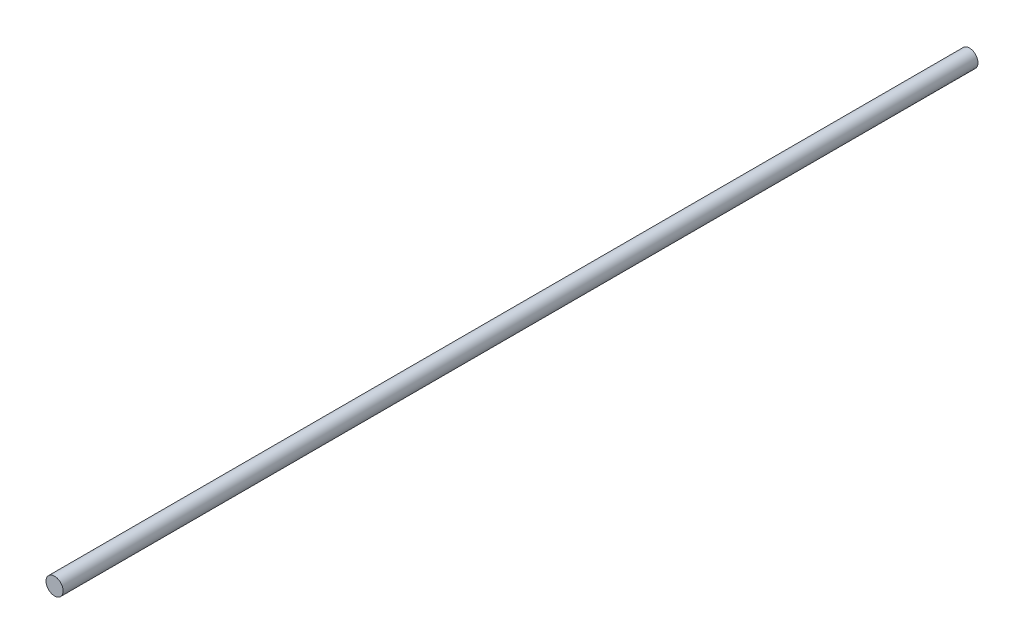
from build123d import *

# Parameters (mm, degrees)
SKETCH1_R           = 30
BOSS_EXTRUDE1_DEPTH = 3200


with BuildPart() as part:
    # Sketch1 → Boss-Extrude1 (new body)
    with BuildSketch(Plane.XY):
        Circle(SKETCH1_R)
    extrude(amount=-BOSS_EXTRUDE1_DEPTH)


solid = part.part
